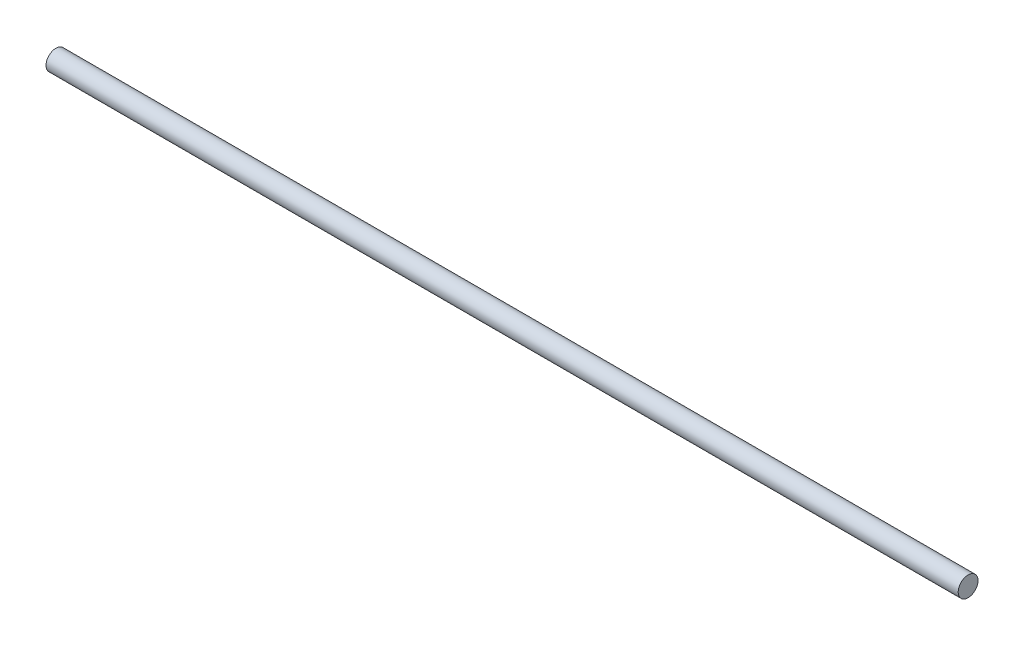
ISO-10303-21;
HEADER;
FILE_DESCRIPTION(('STEP AP214'),'2;1');
FILE_NAME('part.step','',(''),(''),'','','');
FILE_SCHEMA(('AUTOMOTIVE_DESIGN { 1 0 10303 214 1 1 1 1 }'));
ENDSEC;
DATA;
#1=APPLICATION_CONTEXT('core data for automotive mechanical design processes');
#2=APPLICATION_PROTOCOL_DEFINITION('international standard','automotive_design',2000,#1);
#3=PRODUCT_CONTEXT('',#1,'mechanical');
#4=PRODUCT('Part','Part','',(#3));
#5=PRODUCT_RELATED_PRODUCT_CATEGORY('part','',(#4));
#6=PRODUCT_DEFINITION_FORMATION('','',#4);
#7=PRODUCT_DEFINITION_CONTEXT('part definition',#1,'design');
#8=PRODUCT_DEFINITION('design','',#6,#7);
#9=PRODUCT_DEFINITION_SHAPE('','',#8);
#10=(LENGTH_UNIT() NAMED_UNIT(*) SI_UNIT(.MILLI.,.METRE.));
#11=(NAMED_UNIT(*) PLANE_ANGLE_UNIT() SI_UNIT($,.RADIAN.));
#12=(NAMED_UNIT(*) SI_UNIT($,.STERADIAN.) SOLID_ANGLE_UNIT());
#13=UNCERTAINTY_MEASURE_WITH_UNIT(LENGTH_MEASURE(1.E-05),#10,'distance_accuracy_value','');
#14=(GEOMETRIC_REPRESENTATION_CONTEXT(3) GLOBAL_UNCERTAINTY_ASSIGNED_CONTEXT((#13)) GLOBAL_UNIT_ASSIGNED_CONTEXT((#10,
#11,#12)) REPRESENTATION_CONTEXT('',''));
#15=CARTESIAN_POINT('',(0.,0.,0.));
#16=DIRECTION('',(0.,0.,1.));
#17=DIRECTION('',(1.,0.,0.));
#18=AXIS2_PLACEMENT_3D('',#15,#16,#17);
#19=CARTESIAN_POINT('',(1318.225,0.,0.));
#20=DIRECTION('',(-1.,0.,0.));
#21=DIRECTION('',(0.,0.,1.));
#22=AXIS2_PLACEMENT_3D('',#19,#20,#21);
#23=CYLINDRICAL_SURFACE('',#22,28.6639);
#24=CARTESIAN_POINT('',(1318.225,0.,0.));
#25=DIRECTION('',(1.,0.,0.));
#26=DIRECTION('',(0.,0.,-1.));
#27=AXIS2_PLACEMENT_3D('',#24,#25,#26);
#28=CIRCLE('',#27,28.6639);
#29=CARTESIAN_POINT('',(1318.225,0.,28.6639));
#30=VERTEX_POINT('',#29);
#31=EDGE_CURVE('E10',#30,#30,#28,.T.);
#32=CARTESIAN_POINT('',(-1318.225,0.,0.));
#33=DIRECTION('',(1.,0.,0.));
#34=DIRECTION('',(0.,0.,-1.));
#35=AXIS2_PLACEMENT_3D('',#32,#33,#34);
#36=CIRCLE('',#35,28.6639);
#37=CARTESIAN_POINT('',(-1318.225,0.,28.6639));
#38=VERTEX_POINT('',#37);
#39=EDGE_CURVE('E46',#38,#38,#36,.T.);
#40=CARTESIAN_POINT('',(1318.225,0.,28.6639));
#41=CARTESIAN_POINT('',(1290.76197916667,0.,28.6639));
#42=CARTESIAN_POINT('',(1263.29895833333,0.,28.6639));
#43=CARTESIAN_POINT('',(1208.37291666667,0.,28.6639));
#44=CARTESIAN_POINT('',(1180.90989583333,0.,28.6639));
#45=CARTESIAN_POINT('',(1125.98385416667,0.,28.6639));
#46=CARTESIAN_POINT('',(1098.52083333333,0.,28.6639));
#47=CARTESIAN_POINT('',(1043.59479166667,0.,28.6639));
#48=CARTESIAN_POINT('',(1016.13177083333,0.,28.6639));
#49=CARTESIAN_POINT('',(961.205729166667,0.,28.6639));
#50=CARTESIAN_POINT('',(933.742708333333,0.,28.6639));
#51=CARTESIAN_POINT('',(878.816666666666,0.,28.6639));
#52=CARTESIAN_POINT('',(851.353645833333,0.,28.6639));
#53=CARTESIAN_POINT('',(796.427604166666,0.,28.6639));
#54=CARTESIAN_POINT('',(768.964583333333,0.,28.6639));
#55=CARTESIAN_POINT('',(714.038541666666,0.,28.6639));
#56=CARTESIAN_POINT('',(686.575520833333,0.,28.6639));
#57=CARTESIAN_POINT('',(631.649479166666,0.,28.6639));
#58=CARTESIAN_POINT('',(604.186458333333,0.,28.6639));
#59=CARTESIAN_POINT('',(549.260416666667,0.,28.6639));
#60=CARTESIAN_POINT('',(521.797395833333,0.,28.6639));
#61=CARTESIAN_POINT('',(466.871354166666,0.,28.6639));
#62=CARTESIAN_POINT('',(439.408333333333,0.,28.6639));
#63=CARTESIAN_POINT('',(384.482291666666,0.,28.6639));
#64=CARTESIAN_POINT('',(357.019270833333,0.,28.6639));
#65=CARTESIAN_POINT('',(302.093229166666,0.,28.6639));
#66=CARTESIAN_POINT('',(274.630208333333,0.,28.6639));
#67=CARTESIAN_POINT('',(219.704166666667,0.,28.6639));
#68=CARTESIAN_POINT('',(192.241145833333,0.,28.6639));
#69=CARTESIAN_POINT('',(137.315104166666,0.,28.6639));
#70=CARTESIAN_POINT('',(109.852083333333,0.,28.6639));
#71=CARTESIAN_POINT('',(54.9260416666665,0.,28.6639));
#72=CARTESIAN_POINT('',(27.4630208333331,0.,28.6639));
#73=CARTESIAN_POINT('',(-27.4630208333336,0.,28.6639));
#74=CARTESIAN_POINT('',(-54.926041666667,0.,28.6639));
#75=CARTESIAN_POINT('',(-109.852083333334,0.,28.6639));
#76=CARTESIAN_POINT('',(-137.315104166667,0.,28.6639));
#77=CARTESIAN_POINT('',(-192.241145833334,0.,28.6639));
#78=CARTESIAN_POINT('',(-219.704166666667,0.,28.6639));
#79=CARTESIAN_POINT('',(-274.630208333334,0.,28.6639));
#80=CARTESIAN_POINT('',(-302.093229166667,0.,28.6639));
#81=CARTESIAN_POINT('',(-357.019270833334,0.,28.6639));
#82=CARTESIAN_POINT('',(-384.482291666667,0.,28.6639));
#83=CARTESIAN_POINT('',(-439.408333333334,0.,28.6639));
#84=CARTESIAN_POINT('',(-466.871354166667,0.,28.6639));
#85=CARTESIAN_POINT('',(-521.797395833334,0.,28.6639));
#86=CARTESIAN_POINT('',(-549.260416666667,0.,28.6639));
#87=CARTESIAN_POINT('',(-604.186458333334,0.,28.6639));
#88=CARTESIAN_POINT('',(-631.649479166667,0.,28.6639));
#89=CARTESIAN_POINT('',(-686.575520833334,0.,28.6639));
#90=CARTESIAN_POINT('',(-714.038541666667,0.,28.6639));
#91=CARTESIAN_POINT('',(-768.964583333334,0.,28.6639));
#92=CARTESIAN_POINT('',(-796.427604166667,0.,28.6639));
#93=CARTESIAN_POINT('',(-851.353645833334,0.,28.6639));
#94=CARTESIAN_POINT('',(-878.816666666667,0.,28.6639));
#95=CARTESIAN_POINT('',(-933.742708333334,0.,28.6639));
#96=CARTESIAN_POINT('',(-961.205729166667,0.,28.6639));
#97=CARTESIAN_POINT('',(-1016.13177083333,0.,28.6639));
#98=CARTESIAN_POINT('',(-1043.59479166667,0.,28.6639));
#99=CARTESIAN_POINT('',(-1098.52083333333,0.,28.6639));
#100=CARTESIAN_POINT('',(-1125.98385416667,0.,28.6639));
#101=CARTESIAN_POINT('',(-1180.90989583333,0.,28.6639));
#102=CARTESIAN_POINT('',(-1208.37291666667,0.,28.6639));
#103=CARTESIAN_POINT('',(-1263.29895833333,0.,28.6639));
#104=CARTESIAN_POINT('',(-1290.76197916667,0.,28.6639));
#105=CARTESIAN_POINT('',(-1318.225,0.,28.6639));
#106=B_SPLINE_CURVE_WITH_KNOTS('',3,(#40,#41,#42,#43,#44,#45,#46,#47,#48,#49,#50,#51,#52,#53,
#54,#55,#56,#57,#58,#59,#60,#61,#62,#63,#64,#65,#66,#67,#68,#69,#70,#71,#72,#73,#74,#75,#76,#77,
#78,#79,#80,#81,#82,#83,#84,#85,#86,#87,#88,#89,#90,#91,#92,#93,#94,#95,#96,#97,#98,#99,#100,
#101,#102,#103,#104,#105),.UNSPECIFIED.,.F.,.F.,(4,2,2,2,2,2,2,2,2,2,2,2,2,2,2,2,2,2,2,2,2,2,2,
2,2,2,2,2,2,2,2,2,4),(0.,82.3890625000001,164.778125,247.1671875,329.55625,411.9453125,
494.334375,576.7234375,659.1125,741.5015625,823.890625,906.2796875,988.66875,1071.0578125,
1153.446875,1235.8359375,1318.225,1400.6140625,1483.003125,1565.3921875,1647.78125,1730.1703125,
1812.559375,1894.9484375,1977.3375,2059.7265625,2142.115625,2224.5046875,2306.89375,
2389.2828125,2471.671875,2554.0609375,2636.45),.UNSPECIFIED.);
#107=EDGE_CURVE('BSEAM43',#30,#38,#106,.T.);
#108=ORIENTED_EDGE('',*,*,#31,.F.);
#109=ORIENTED_EDGE('',*,*,#39,.T.);
#110=ORIENTED_EDGE('',*,*,#107,.T.);
#111=ORIENTED_EDGE('',*,*,#107,.F.);
#112=EDGE_LOOP('',(#108,#110,#109,#111));
#113=FACE_BOUND('',#112,.T.);
#114=ADVANCED_FACE('F43',(#113),#23,.T.);
#115=CARTESIAN_POINT('',(1318.225,0.,0.));
#116=DIRECTION('',(1.,0.,0.));
#117=DIRECTION('',(0.,0.,-1.));
#118=AXIS2_PLACEMENT_3D('',#115,#116,#117);
#119=PLANE('',#118);
#120=ORIENTED_EDGE('',*,*,#31,.T.);
#121=EDGE_LOOP('',(#120));
#122=FACE_BOUND('',#121,.T.);
#123=ADVANCED_FACE('F58',(#122),#119,.T.);
#124=CARTESIAN_POINT('',(-1318.225,0.,0.));
#125=DIRECTION('',(1.,0.,0.));
#126=DIRECTION('',(0.,0.,-1.));
#127=AXIS2_PLACEMENT_3D('',#124,#125,#126);
#128=PLANE('',#127);
#129=ORIENTED_EDGE('',*,*,#39,.F.);
#130=EDGE_LOOP('',(#129));
#131=FACE_BOUND('',#130,.T.);
#132=ADVANCED_FACE('F59',(#131),#128,.F.);
#133=CLOSED_SHELL('',(#114,#123,#132));
#134=MANIFOLD_SOLID_BREP('B2',#133);
#135=ADVANCED_BREP_SHAPE_REPRESENTATION('',(#18,#134),#14);
#136=SHAPE_DEFINITION_REPRESENTATION(#9,#135);
ENDSEC;
END-ISO-10303-21;
